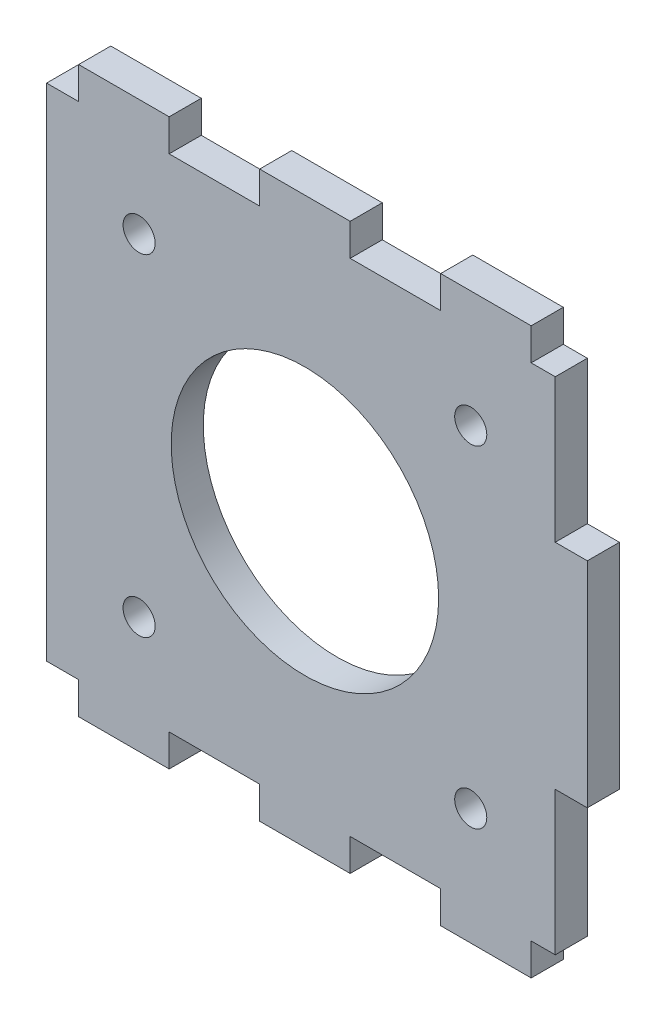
ISO-10303-21;
HEADER;
FILE_DESCRIPTION(('STEP AP214'),'2;1');
FILE_NAME('part.step','',(''),(''),'','','');
FILE_SCHEMA(('AUTOMOTIVE_DESIGN { 1 0 10303 214 1 1 1 1 }'));
ENDSEC;
DATA;
#1=APPLICATION_CONTEXT('core data for automotive mechanical design processes');
#2=APPLICATION_PROTOCOL_DEFINITION('international standard','automotive_design',2000,#1);
#3=PRODUCT_CONTEXT('',#1,'mechanical');
#4=PRODUCT('Part','Part','',(#3));
#5=PRODUCT_RELATED_PRODUCT_CATEGORY('part','',(#4));
#6=PRODUCT_DEFINITION_FORMATION('','',#4);
#7=PRODUCT_DEFINITION_CONTEXT('part definition',#1,'design');
#8=PRODUCT_DEFINITION('design','',#6,#7);
#9=PRODUCT_DEFINITION_SHAPE('','',#8);
#10=(LENGTH_UNIT() NAMED_UNIT(*) SI_UNIT(.MILLI.,.METRE.));
#11=(NAMED_UNIT(*) PLANE_ANGLE_UNIT() SI_UNIT($,.RADIAN.));
#12=(NAMED_UNIT(*) SI_UNIT($,.STERADIAN.) SOLID_ANGLE_UNIT());
#13=UNCERTAINTY_MEASURE_WITH_UNIT(LENGTH_MEASURE(1.E-05),#10,'distance_accuracy_value','');
#14=(GEOMETRIC_REPRESENTATION_CONTEXT(3) GLOBAL_UNCERTAINTY_ASSIGNED_CONTEXT((#13)) GLOBAL_UNIT_ASSIGNED_CONTEXT((#10,
#11,#12)) REPRESENTATION_CONTEXT('',''));
#15=CARTESIAN_POINT('',(0.,0.,0.));
#16=DIRECTION('',(0.,0.,1.));
#17=DIRECTION('',(1.,0.,0.));
#18=AXIS2_PLACEMENT_3D('',#15,#16,#17);
#19=CARTESIAN_POINT('',(0.,23.4000000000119,3.));
#20=DIRECTION('',(0.,-1.,0.));
#21=DIRECTION('',(0.,0.,-1.));
#22=AXIS2_PLACEMENT_3D('',#19,#20,#21);
#23=PLANE('',#22);
#24=DIRECTION('',(-1.,0.,0.));
#25=VECTOR('',#24,1.);
#26=CARTESIAN_POINT('',(0.,23.4000000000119,0.));
#27=LINE('',#26,#25);
#28=CARTESIAN_POINT('',(22.2749999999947,23.4000000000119,0.));
#29=VERTEX_POINT('',#28);
#30=CARTESIAN_POINT('',(20.0250000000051,23.4000000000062,0.));
#31=VERTEX_POINT('',#30);
#32=EDGE_CURVE('E290',#29,#31,#27,.T.);
#33=ORIENTED_EDGE('',*,*,#32,.T.);
#34=DIRECTION('',(0.,0.,-1.));
#35=VECTOR('',#34,1.);
#36=CARTESIAN_POINT('',(20.0250000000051,23.4000000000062,3.));
#37=LINE('',#36,#35);
#38=CARTESIAN_POINT('',(20.0250000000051,23.4000000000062,3.));
#39=VERTEX_POINT('',#38);
#40=EDGE_CURVE('E11',#39,#31,#37,.T.);
#41=ORIENTED_EDGE('',*,*,#40,.F.);
#42=DIRECTION('',(-1.,0.,0.));
#43=VECTOR('',#42,1.);
#44=CARTESIAN_POINT('',(0.,23.4000000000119,3.));
#45=LINE('',#44,#43);
#46=CARTESIAN_POINT('',(22.2749999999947,23.4000000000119,3.));
#47=VERTEX_POINT('',#46);
#48=EDGE_CURVE('E160',#47,#39,#45,.T.);
#49=ORIENTED_EDGE('',*,*,#48,.F.);
#50=DIRECTION('',(0.,0.,-1.));
#51=VECTOR('',#50,1.);
#52=CARTESIAN_POINT('',(22.2749999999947,23.4000000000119,3.));
#53=LINE('',#52,#51);
#54=EDGE_CURVE('E51',#47,#29,#53,.T.);
#55=ORIENTED_EDGE('',*,*,#54,.T.);
#56=EDGE_LOOP('',(#33,#41,#49,#55));
#57=FACE_BOUND('',#56,.T.);
#58=ADVANCED_FACE('F34',(#57),#23,.F.);
#59=CARTESIAN_POINT('',(20.0250000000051,0.,3.));
#60=DIRECTION('',(1.,0.,0.));
#61=DIRECTION('',(0.,0.,-1.));
#62=AXIS2_PLACEMENT_3D('',#59,#60,#61);
#63=PLANE('',#62);
#64=DIRECTION('',(0.,-1.,0.));
#65=VECTOR('',#64,1.);
#66=CARTESIAN_POINT('',(20.0250000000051,0.,0.));
#67=LINE('',#66,#65);
#68=CARTESIAN_POINT('',(20.0250000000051,26.4000000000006,0.));
#69=VERTEX_POINT('',#68);
#70=EDGE_CURVE('E292',#69,#31,#67,.T.);
#71=ORIENTED_EDGE('',*,*,#70,.F.);
#72=DIRECTION('',(0.,0.,-1.));
#73=VECTOR('',#72,1.);
#74=CARTESIAN_POINT('',(20.0250000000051,26.4000000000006,3.));
#75=LINE('',#74,#73);
#76=CARTESIAN_POINT('',(20.0250000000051,26.4000000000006,3.));
#77=VERTEX_POINT('',#76);
#78=EDGE_CURVE('E43',#77,#69,#75,.T.);
#79=ORIENTED_EDGE('',*,*,#78,.F.);
#80=DIRECTION('',(0.,-1.,0.));
#81=VECTOR('',#80,1.);
#82=CARTESIAN_POINT('',(20.0250000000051,0.,3.));
#83=LINE('',#82,#81);
#84=EDGE_CURVE('E444',#77,#39,#83,.T.);
#85=ORIENTED_EDGE('',*,*,#84,.T.);
#86=ORIENTED_EDGE('',*,*,#40,.T.);
#87=EDGE_LOOP('',(#71,#79,#85,#86));
#88=FACE_BOUND('',#87,.T.);
#89=ADVANCED_FACE('F432',(#88),#63,.T.);
#90=CARTESIAN_POINT('',(0.,26.4000000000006,3.));
#91=DIRECTION('',(0.,1.,0.));
#92=DIRECTION('',(0.,0.,1.));
#93=AXIS2_PLACEMENT_3D('',#90,#91,#92);
#94=PLANE('',#93);
#95=DIRECTION('',(1.,0.,0.));
#96=VECTOR('',#95,1.);
#97=CARTESIAN_POINT('',(0.,26.4000000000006,0.));
#98=LINE('',#97,#96);
#99=CARTESIAN_POINT('',(11.565000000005,26.4000000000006,0.));
#100=VERTEX_POINT('',#99);
#101=EDGE_CURVE('E297',#100,#69,#98,.T.);
#102=ORIENTED_EDGE('',*,*,#101,.F.);
#103=DIRECTION('',(0.,0.,-1.));
#104=VECTOR('',#103,1.);
#105=CARTESIAN_POINT('',(11.565000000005,26.4000000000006,3.));
#106=LINE('',#105,#104);
#107=CARTESIAN_POINT('',(11.565000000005,26.4000000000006,3.));
#108=VERTEX_POINT('',#107);
#109=EDGE_CURVE('E422',#108,#100,#106,.T.);
#110=ORIENTED_EDGE('',*,*,#109,.F.);
#111=DIRECTION('',(1.,0.,0.));
#112=VECTOR('',#111,1.);
#113=CARTESIAN_POINT('',(0.,26.4000000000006,3.));
#114=LINE('',#113,#112);
#115=EDGE_CURVE('E429',#108,#77,#114,.T.);
#116=ORIENTED_EDGE('',*,*,#115,.T.);
#117=ORIENTED_EDGE('',*,*,#78,.T.);
#118=EDGE_LOOP('',(#102,#110,#116,#117));
#119=FACE_BOUND('',#118,.T.);
#120=ADVANCED_FACE('F427',(#119),#94,.T.);
#121=CARTESIAN_POINT('',(11.565000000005,0.,3.));
#122=DIRECTION('',(-1.,0.,0.));
#123=DIRECTION('',(0.,0.,1.));
#124=AXIS2_PLACEMENT_3D('',#121,#122,#123);
#125=PLANE('',#124);
#126=DIRECTION('',(0.,1.,0.));
#127=VECTOR('',#126,1.);
#128=CARTESIAN_POINT('',(11.565000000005,0.,0.));
#129=LINE('',#128,#127);
#130=CARTESIAN_POINT('',(11.565000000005,23.4000000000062,0.));
#131=VERTEX_POINT('',#130);
#132=EDGE_CURVE('E300',#131,#100,#129,.T.);
#133=ORIENTED_EDGE('',*,*,#132,.F.);
#134=DIRECTION('',(0.,0.,-1.));
#135=VECTOR('',#134,1.);
#136=CARTESIAN_POINT('',(11.565000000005,23.4000000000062,3.));
#137=LINE('',#136,#135);
#138=CARTESIAN_POINT('',(11.565000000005,23.4000000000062,3.));
#139=VERTEX_POINT('',#138);
#140=EDGE_CURVE('E420',#139,#131,#137,.T.);
#141=ORIENTED_EDGE('',*,*,#140,.F.);
#142=DIRECTION('',(0.,1.,0.));
#143=VECTOR('',#142,1.);
#144=CARTESIAN_POINT('',(11.565000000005,0.,3.));
#145=LINE('',#144,#143);
#146=EDGE_CURVE('E443',#139,#108,#145,.T.);
#147=ORIENTED_EDGE('',*,*,#146,.T.);
#148=ORIENTED_EDGE('',*,*,#109,.T.);
#149=EDGE_LOOP('',(#133,#141,#147,#148));
#150=FACE_BOUND('',#149,.T.);
#151=ADVANCED_FACE('F439',(#150),#125,.T.);
#152=CARTESIAN_POINT('',(3.10500000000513,23.4000000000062,0.));
#153=VERTEX_POINT('',#152);
#154=EDGE_CURVE('E294',#131,#153,#27,.T.);
#155=ORIENTED_EDGE('',*,*,#154,.T.);
#156=DIRECTION('',(0.,0.,-1.));
#157=VECTOR('',#156,1.);
#158=CARTESIAN_POINT('',(3.10500000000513,23.4000000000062,3.));
#159=LINE('',#158,#157);
#160=CARTESIAN_POINT('',(3.10500000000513,23.4000000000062,3.));
#161=VERTEX_POINT('',#160);
#162=EDGE_CURVE('E418',#161,#153,#159,.T.);
#163=ORIENTED_EDGE('',*,*,#162,.F.);
#164=EDGE_CURVE('E446',#139,#161,#45,.T.);
#165=ORIENTED_EDGE('',*,*,#164,.F.);
#166=ORIENTED_EDGE('',*,*,#140,.T.);
#167=EDGE_LOOP('',(#155,#163,#165,#166));
#168=FACE_BOUND('',#167,.T.);
#169=ADVANCED_FACE('F630',(#168),#23,.F.);
#170=CARTESIAN_POINT('',(3.10500000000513,0.,3.));
#171=DIRECTION('',(1.,0.,0.));
#172=DIRECTION('',(0.,0.,-1.));
#173=AXIS2_PLACEMENT_3D('',#170,#171,#172);
#174=PLANE('',#173);
#175=DIRECTION('',(0.,-1.,0.));
#176=VECTOR('',#175,1.);
#177=CARTESIAN_POINT('',(3.10500000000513,0.,0.));
#178=LINE('',#177,#176);
#179=CARTESIAN_POINT('',(3.10500000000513,26.4000000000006,0.));
#180=VERTEX_POINT('',#179);
#181=EDGE_CURVE('E303',#180,#153,#178,.T.);
#182=ORIENTED_EDGE('',*,*,#181,.F.);
#183=DIRECTION('',(0.,0.,-1.));
#184=VECTOR('',#183,1.);
#185=CARTESIAN_POINT('',(3.10500000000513,26.4000000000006,3.));
#186=LINE('',#185,#184);
#187=CARTESIAN_POINT('',(3.10500000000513,26.4000000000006,3.));
#188=VERTEX_POINT('',#187);
#189=EDGE_CURVE('E416',#188,#180,#186,.T.);
#190=ORIENTED_EDGE('',*,*,#189,.F.);
#191=DIRECTION('',(0.,-1.,0.));
#192=VECTOR('',#191,1.);
#193=CARTESIAN_POINT('',(3.10500000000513,0.,3.));
#194=LINE('',#193,#192);
#195=EDGE_CURVE('E451',#188,#161,#194,.T.);
#196=ORIENTED_EDGE('',*,*,#195,.T.);
#197=ORIENTED_EDGE('',*,*,#162,.T.);
#198=EDGE_LOOP('',(#182,#190,#196,#197));
#199=FACE_BOUND('',#198,.T.);
#200=ADVANCED_FACE('F638',(#199),#174,.T.);
#201=CARTESIAN_POINT('',(0.,26.4000000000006,3.));
#202=DIRECTION('',(0.,1.,0.));
#203=DIRECTION('',(0.,0.,1.));
#204=AXIS2_PLACEMENT_3D('',#201,#202,#203);
#205=PLANE('',#204);
#206=DIRECTION('',(1.,0.,0.));
#207=VECTOR('',#206,1.);
#208=CARTESIAN_POINT('',(0.,26.4000000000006,0.));
#209=LINE('',#208,#207);
#210=CARTESIAN_POINT('',(-5.35499999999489,26.4000000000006,0.));
#211=VERTEX_POINT('',#210);
#212=EDGE_CURVE('E306',#211,#180,#209,.T.);
#213=ORIENTED_EDGE('',*,*,#212,.F.);
#214=DIRECTION('',(0.,0.,-1.));
#215=VECTOR('',#214,1.);
#216=CARTESIAN_POINT('',(-5.35499999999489,26.4000000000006,3.));
#217=LINE('',#216,#215);
#218=CARTESIAN_POINT('',(-5.35499999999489,26.4000000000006,3.));
#219=VERTEX_POINT('',#218);
#220=EDGE_CURVE('E414',#219,#211,#217,.T.);
#221=ORIENTED_EDGE('',*,*,#220,.F.);
#222=DIRECTION('',(1.,0.,0.));
#223=VECTOR('',#222,1.);
#224=CARTESIAN_POINT('',(0.,26.4000000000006,3.));
#225=LINE('',#224,#223);
#226=EDGE_CURVE('E454',#219,#188,#225,.T.);
#227=ORIENTED_EDGE('',*,*,#226,.T.);
#228=ORIENTED_EDGE('',*,*,#189,.T.);
#229=EDGE_LOOP('',(#213,#221,#227,#228));
#230=FACE_BOUND('',#229,.T.);
#231=ADVANCED_FACE('F652',(#230),#205,.T.);
#232=CARTESIAN_POINT('',(-5.35499999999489,0.,3.));
#233=DIRECTION('',(-1.,0.,0.));
#234=DIRECTION('',(0.,0.,1.));
#235=AXIS2_PLACEMENT_3D('',#232,#233,#234);
#236=PLANE('',#235);
#237=DIRECTION('',(0.,1.,0.));
#238=VECTOR('',#237,1.);
#239=CARTESIAN_POINT('',(-5.35499999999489,0.,0.));
#240=LINE('',#239,#238);
#241=CARTESIAN_POINT('',(-5.35499999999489,23.4000000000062,0.));
#242=VERTEX_POINT('',#241);
#243=EDGE_CURVE('E309',#242,#211,#240,.T.);
#244=ORIENTED_EDGE('',*,*,#243,.F.);
#245=DIRECTION('',(0.,0.,-1.));
#246=VECTOR('',#245,1.);
#247=CARTESIAN_POINT('',(-5.35499999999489,23.4000000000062,3.));
#248=LINE('',#247,#246);
#249=CARTESIAN_POINT('',(-5.35499999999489,23.4000000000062,3.));
#250=VERTEX_POINT('',#249);
#251=EDGE_CURVE('E412',#250,#242,#248,.T.);
#252=ORIENTED_EDGE('',*,*,#251,.F.);
#253=DIRECTION('',(0.,1.,0.));
#254=VECTOR('',#253,1.);
#255=CARTESIAN_POINT('',(-5.35499999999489,0.,3.));
#256=LINE('',#255,#254);
#257=EDGE_CURVE('E457',#250,#219,#256,.T.);
#258=ORIENTED_EDGE('',*,*,#257,.T.);
#259=ORIENTED_EDGE('',*,*,#220,.T.);
#260=EDGE_LOOP('',(#244,#252,#258,#259));
#261=FACE_BOUND('',#260,.T.);
#262=ADVANCED_FACE('F646',(#261),#236,.T.);
#263=CARTESIAN_POINT('',(-13.8149999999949,23.4000000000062,0.));
#264=VERTEX_POINT('',#263);
#265=EDGE_CURVE('E312',#242,#264,#27,.T.);
#266=ORIENTED_EDGE('',*,*,#265,.T.);
#267=DIRECTION('',(0.,0.,-1.));
#268=VECTOR('',#267,1.);
#269=CARTESIAN_POINT('',(-13.8149999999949,23.4000000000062,3.));
#270=LINE('',#269,#268);
#271=CARTESIAN_POINT('',(-13.8149999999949,23.4000000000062,3.));
#272=VERTEX_POINT('',#271);
#273=EDGE_CURVE('E410',#272,#264,#270,.T.);
#274=ORIENTED_EDGE('',*,*,#273,.F.);
#275=EDGE_CURVE('E460',#250,#272,#45,.T.);
#276=ORIENTED_EDGE('',*,*,#275,.F.);
#277=ORIENTED_EDGE('',*,*,#251,.T.);
#278=EDGE_LOOP('',(#266,#274,#276,#277));
#279=FACE_BOUND('',#278,.T.);
#280=ADVANCED_FACE('F538',(#279),#23,.F.);
#281=CARTESIAN_POINT('',(-13.8149999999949,0.,3.));
#282=DIRECTION('',(1.,0.,0.));
#283=DIRECTION('',(0.,0.,-1.));
#284=AXIS2_PLACEMENT_3D('',#281,#282,#283);
#285=PLANE('',#284);
#286=DIRECTION('',(0.,-1.,0.));
#287=VECTOR('',#286,1.);
#288=CARTESIAN_POINT('',(-13.8149999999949,0.,0.));
#289=LINE('',#288,#287);
#290=CARTESIAN_POINT('',(-13.8149999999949,26.4000000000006,0.));
#291=VERTEX_POINT('',#290);
#292=EDGE_CURVE('E313',#291,#264,#289,.T.);
#293=ORIENTED_EDGE('',*,*,#292,.F.);
#294=DIRECTION('',(0.,0.,-1.));
#295=VECTOR('',#294,1.);
#296=CARTESIAN_POINT('',(-13.8149999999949,26.4000000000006,3.));
#297=LINE('',#296,#295);
#298=CARTESIAN_POINT('',(-13.8149999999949,26.4000000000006,3.));
#299=VERTEX_POINT('',#298);
#300=EDGE_CURVE('E408',#299,#291,#297,.T.);
#301=ORIENTED_EDGE('',*,*,#300,.F.);
#302=DIRECTION('',(0.,-1.,0.));
#303=VECTOR('',#302,1.);
#304=CARTESIAN_POINT('',(-13.8149999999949,0.,3.));
#305=LINE('',#304,#303);
#306=EDGE_CURVE('E461',#299,#272,#305,.T.);
#307=ORIENTED_EDGE('',*,*,#306,.T.);
#308=ORIENTED_EDGE('',*,*,#273,.T.);
#309=EDGE_LOOP('',(#293,#301,#307,#308));
#310=FACE_BOUND('',#309,.T.);
#311=ADVANCED_FACE('F542',(#310),#285,.T.);
#312=CARTESIAN_POINT('',(0.,26.4000000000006,3.));
#313=DIRECTION('',(0.,1.,0.));
#314=DIRECTION('',(0.,0.,1.));
#315=AXIS2_PLACEMENT_3D('',#312,#313,#314);
#316=PLANE('',#315);
#317=DIRECTION('',(1.,0.,0.));
#318=VECTOR('',#317,1.);
#319=CARTESIAN_POINT('',(0.,26.4000000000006,0.));
#320=LINE('',#319,#318);
#321=CARTESIAN_POINT('',(-22.2749999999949,26.4000000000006,0.));
#322=VERTEX_POINT('',#321);
#323=EDGE_CURVE('E316',#322,#291,#320,.T.);
#324=ORIENTED_EDGE('',*,*,#323,.F.);
#325=DIRECTION('',(0.,0.,-1.));
#326=VECTOR('',#325,1.);
#327=CARTESIAN_POINT('',(-22.2749999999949,26.4000000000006,3.));
#328=LINE('',#327,#326);
#329=CARTESIAN_POINT('',(-22.2749999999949,26.4000000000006,3.));
#330=VERTEX_POINT('',#329);
#331=EDGE_CURVE('E406',#330,#322,#328,.T.);
#332=ORIENTED_EDGE('',*,*,#331,.F.);
#333=DIRECTION('',(1.,0.,0.));
#334=VECTOR('',#333,1.);
#335=CARTESIAN_POINT('',(0.,26.4000000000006,3.));
#336=LINE('',#335,#334);
#337=EDGE_CURVE('E464',#330,#299,#336,.T.);
#338=ORIENTED_EDGE('',*,*,#337,.T.);
#339=ORIENTED_EDGE('',*,*,#300,.T.);
#340=EDGE_LOOP('',(#324,#332,#338,#339));
#341=FACE_BOUND('',#340,.T.);
#342=ADVANCED_FACE('F545',(#341),#316,.T.);
#343=CARTESIAN_POINT('',(-22.2749999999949,0.,3.));
#344=DIRECTION('',(-1.,0.,0.));
#345=DIRECTION('',(0.,0.,1.));
#346=AXIS2_PLACEMENT_3D('',#343,#344,#345);
#347=PLANE('',#346);
#348=DIRECTION('',(0.,1.,0.));
#349=VECTOR('',#348,1.);
#350=CARTESIAN_POINT('',(-22.2749999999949,0.,0.));
#351=LINE('',#350,#349);
#352=CARTESIAN_POINT('',(-22.2749999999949,23.4000000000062,0.));
#353=VERTEX_POINT('',#352);
#354=EDGE_CURVE('E319',#353,#322,#351,.T.);
#355=ORIENTED_EDGE('',*,*,#354,.F.);
#356=DIRECTION('',(0.,0.,-1.));
#357=VECTOR('',#356,1.);
#358=CARTESIAN_POINT('',(-22.2749999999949,23.4000000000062,3.));
#359=LINE('',#358,#357);
#360=CARTESIAN_POINT('',(-22.2749999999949,23.4000000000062,3.));
#361=VERTEX_POINT('',#360);
#362=EDGE_CURVE('E404',#361,#353,#359,.T.);
#363=ORIENTED_EDGE('',*,*,#362,.F.);
#364=DIRECTION('',(0.,1.,0.));
#365=VECTOR('',#364,1.);
#366=CARTESIAN_POINT('',(-22.2749999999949,0.,3.));
#367=LINE('',#366,#365);
#368=EDGE_CURVE('E467',#361,#330,#367,.T.);
#369=ORIENTED_EDGE('',*,*,#368,.T.);
#370=ORIENTED_EDGE('',*,*,#331,.T.);
#371=EDGE_LOOP('',(#355,#363,#369,#370));
#372=FACE_BOUND('',#371,.T.);
#373=ADVANCED_FACE('F549',(#372),#347,.T.);
#374=CARTESIAN_POINT('',(-25.2749999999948,23.4000000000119,0.));
#375=VERTEX_POINT('',#374);
#376=EDGE_CURVE('E293',#353,#375,#27,.T.);
#377=ORIENTED_EDGE('',*,*,#376,.T.);
#378=DIRECTION('',(0.,0.,-1.));
#379=VECTOR('',#378,1.);
#380=CARTESIAN_POINT('',(-25.2749999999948,23.4000000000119,3.));
#381=LINE('',#380,#379);
#382=CARTESIAN_POINT('',(-25.2749999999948,23.4000000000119,3.));
#383=VERTEX_POINT('',#382);
#384=EDGE_CURVE('E401',#383,#375,#381,.T.);
#385=ORIENTED_EDGE('',*,*,#384,.F.);
#386=EDGE_CURVE('E470',#361,#383,#45,.T.);
#387=ORIENTED_EDGE('',*,*,#386,.F.);
#388=ORIENTED_EDGE('',*,*,#362,.T.);
#389=EDGE_LOOP('',(#377,#385,#387,#388));
#390=FACE_BOUND('',#389,.T.);
#391=ADVANCED_FACE('F554',(#390),#23,.F.);
#392=CARTESIAN_POINT('',(-25.2749999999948,0.,3.));
#393=DIRECTION('',(1.,0.,0.));
#394=DIRECTION('',(0.,0.,-1.));
#395=AXIS2_PLACEMENT_3D('',#392,#393,#394);
#396=PLANE('',#395);
#397=DIRECTION('',(0.,-1.,0.));
#398=VECTOR('',#397,1.);
#399=CARTESIAN_POINT('',(-25.2749999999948,0.,0.));
#400=LINE('',#399,#398);
#401=CARTESIAN_POINT('',(-25.2749999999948,-23.4000000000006,0.));
#402=VERTEX_POINT('',#401);
#403=EDGE_CURVE('E322',#375,#402,#400,.T.);
#404=ORIENTED_EDGE('',*,*,#403,.T.);
#405=DIRECTION('',(0.,0.,-1.));
#406=VECTOR('',#405,1.);
#407=CARTESIAN_POINT('',(-25.2749999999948,-23.4000000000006,3.));
#408=LINE('',#407,#406);
#409=CARTESIAN_POINT('',(-25.2749999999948,-23.4000000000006,3.));
#410=VERTEX_POINT('',#409);
#411=EDGE_CURVE('E399',#410,#402,#408,.T.);
#412=ORIENTED_EDGE('',*,*,#411,.F.);
#413=DIRECTION('',(0.,-1.,0.));
#414=VECTOR('',#413,1.);
#415=CARTESIAN_POINT('',(-25.2749999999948,0.,3.));
#416=LINE('',#415,#414);
#417=EDGE_CURVE('E471',#383,#410,#416,.T.);
#418=ORIENTED_EDGE('',*,*,#417,.F.);
#419=ORIENTED_EDGE('',*,*,#384,.T.);
#420=EDGE_LOOP('',(#404,#412,#418,#419));
#421=FACE_BOUND('',#420,.T.);
#422=ADVANCED_FACE('F560',(#421),#396,.F.);
#423=CARTESIAN_POINT('',(0.,-23.4000000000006,3.));
#424=DIRECTION('',(0.,-1.,0.));
#425=DIRECTION('',(0.,0.,-1.));
#426=AXIS2_PLACEMENT_3D('',#423,#424,#425);
#427=PLANE('',#426);
#428=DIRECTION('',(-1.,0.,0.));
#429=VECTOR('',#428,1.);
#430=CARTESIAN_POINT('',(0.,-23.4000000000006,0.));
#431=LINE('',#430,#429);
#432=CARTESIAN_POINT('',(-22.2749999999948,-23.4000000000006,0.));
#433=VERTEX_POINT('',#432);
#434=EDGE_CURVE('E325',#433,#402,#431,.T.);
#435=ORIENTED_EDGE('',*,*,#434,.F.);
#436=DIRECTION('',(0.,0.,-1.));
#437=VECTOR('',#436,1.);
#438=CARTESIAN_POINT('',(-22.2749999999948,-23.4000000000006,3.));
#439=LINE('',#438,#437);
#440=CARTESIAN_POINT('',(-22.2749999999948,-23.4000000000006,3.));
#441=VERTEX_POINT('',#440);
#442=EDGE_CURVE('E397',#441,#433,#439,.T.);
#443=ORIENTED_EDGE('',*,*,#442,.F.);
#444=DIRECTION('',(-1.,0.,0.));
#445=VECTOR('',#444,1.);
#446=CARTESIAN_POINT('',(0.,-23.4000000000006,3.));
#447=LINE('',#446,#445);
#448=EDGE_CURVE('E473',#441,#410,#447,.T.);
#449=ORIENTED_EDGE('',*,*,#448,.T.);
#450=ORIENTED_EDGE('',*,*,#411,.T.);
#451=EDGE_LOOP('',(#435,#443,#449,#450));
#452=FACE_BOUND('',#451,.T.);
#453=ADVANCED_FACE('F564',(#452),#427,.T.);
#454=CARTESIAN_POINT('',(-22.2749999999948,0.,3.));
#455=DIRECTION('',(-1.,0.,0.));
#456=DIRECTION('',(0.,0.,1.));
#457=AXIS2_PLACEMENT_3D('',#454,#455,#456);
#458=PLANE('',#457);
#459=DIRECTION('',(0.,1.,0.));
#460=VECTOR('',#459,1.);
#461=CARTESIAN_POINT('',(-22.2749999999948,0.,0.));
#462=LINE('',#461,#460);
#463=CARTESIAN_POINT('',(-22.2749999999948,-26.4000000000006,0.));
#464=VERTEX_POINT('',#463);
#465=EDGE_CURVE('E328',#464,#433,#462,.T.);
#466=ORIENTED_EDGE('',*,*,#465,.F.);
#467=DIRECTION('',(0.,0.,-1.));
#468=VECTOR('',#467,1.);
#469=CARTESIAN_POINT('',(-22.2749999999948,-26.4000000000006,3.));
#470=LINE('',#469,#468);
#471=CARTESIAN_POINT('',(-22.2749999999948,-26.4000000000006,3.));
#472=VERTEX_POINT('',#471);
#473=EDGE_CURVE('E395',#472,#464,#470,.T.);
#474=ORIENTED_EDGE('',*,*,#473,.F.);
#475=DIRECTION('',(0.,1.,0.));
#476=VECTOR('',#475,1.);
#477=CARTESIAN_POINT('',(-22.2749999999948,0.,3.));
#478=LINE('',#477,#476);
#479=EDGE_CURVE('E476',#472,#441,#478,.T.);
#480=ORIENTED_EDGE('',*,*,#479,.T.);
#481=ORIENTED_EDGE('',*,*,#442,.T.);
#482=EDGE_LOOP('',(#466,#474,#480,#481));
#483=FACE_BOUND('',#482,.T.);
#484=ADVANCED_FACE('F567',(#483),#458,.T.);
#485=CARTESIAN_POINT('',(0.,-26.4000000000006,3.));
#486=DIRECTION('',(0.,-1.,0.));
#487=DIRECTION('',(0.,0.,-1.));
#488=AXIS2_PLACEMENT_3D('',#485,#486,#487);
#489=PLANE('',#488);
#490=DIRECTION('',(-1.,0.,0.));
#491=VECTOR('',#490,1.);
#492=CARTESIAN_POINT('',(0.,-26.4000000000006,0.));
#493=LINE('',#492,#491);
#494=CARTESIAN_POINT('',(-13.8149999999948,-26.4000000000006,0.));
#495=VERTEX_POINT('',#494);
#496=EDGE_CURVE('E333',#495,#464,#493,.T.);
#497=ORIENTED_EDGE('',*,*,#496,.F.);
#498=DIRECTION('',(0.,0.,-1.));
#499=VECTOR('',#498,1.);
#500=CARTESIAN_POINT('',(-13.8149999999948,-26.4000000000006,3.));
#501=LINE('',#500,#499);
#502=CARTESIAN_POINT('',(-13.8149999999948,-26.4000000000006,3.));
#503=VERTEX_POINT('',#502);
#504=EDGE_CURVE('E393',#503,#495,#501,.T.);
#505=ORIENTED_EDGE('',*,*,#504,.F.);
#506=DIRECTION('',(-1.,0.,0.));
#507=VECTOR('',#506,1.);
#508=CARTESIAN_POINT('',(0.,-26.4000000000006,3.));
#509=LINE('',#508,#507);
#510=EDGE_CURVE('E481',#503,#472,#509,.T.);
#511=ORIENTED_EDGE('',*,*,#510,.T.);
#512=ORIENTED_EDGE('',*,*,#473,.T.);
#513=EDGE_LOOP('',(#497,#505,#511,#512));
#514=FACE_BOUND('',#513,.T.);
#515=ADVANCED_FACE('F572',(#514),#489,.T.);
#516=CARTESIAN_POINT('',(-13.8149999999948,0.,3.));
#517=DIRECTION('',(1.,0.,0.));
#518=DIRECTION('',(0.,0.,-1.));
#519=AXIS2_PLACEMENT_3D('',#516,#517,#518);
#520=PLANE('',#519);
#521=DIRECTION('',(0.,-1.,0.));
#522=VECTOR('',#521,1.);
#523=CARTESIAN_POINT('',(-13.8149999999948,0.,0.));
#524=LINE('',#523,#522);
#525=CARTESIAN_POINT('',(-13.8149999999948,-23.4000000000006,0.));
#526=VERTEX_POINT('',#525);
#527=EDGE_CURVE('E336',#526,#495,#524,.T.);
#528=ORIENTED_EDGE('',*,*,#527,.F.);
#529=DIRECTION('',(0.,0.,-1.));
#530=VECTOR('',#529,1.);
#531=CARTESIAN_POINT('',(-13.8149999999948,-23.4000000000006,3.));
#532=LINE('',#531,#530);
#533=CARTESIAN_POINT('',(-13.8149999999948,-23.4000000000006,3.));
#534=VERTEX_POINT('',#533);
#535=EDGE_CURVE('E391',#534,#526,#532,.T.);
#536=ORIENTED_EDGE('',*,*,#535,.F.);
#537=DIRECTION('',(0.,-1.,0.));
#538=VECTOR('',#537,1.);
#539=CARTESIAN_POINT('',(-13.8149999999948,0.,3.));
#540=LINE('',#539,#538);
#541=EDGE_CURVE('E484',#534,#503,#540,.T.);
#542=ORIENTED_EDGE('',*,*,#541,.T.);
#543=ORIENTED_EDGE('',*,*,#504,.T.);
#544=EDGE_LOOP('',(#528,#536,#542,#543));
#545=FACE_BOUND('',#544,.T.);
#546=ADVANCED_FACE('F575',(#545),#520,.T.);
#547=CARTESIAN_POINT('',(-5.35499999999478,-23.4000000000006,0.));
#548=VERTEX_POINT('',#547);
#549=EDGE_CURVE('E330',#548,#526,#431,.T.);
#550=ORIENTED_EDGE('',*,*,#549,.F.);
#551=DIRECTION('',(0.,0.,-1.));
#552=VECTOR('',#551,1.);
#553=CARTESIAN_POINT('',(-5.35499999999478,-23.4000000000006,3.));
#554=LINE('',#553,#552);
#555=CARTESIAN_POINT('',(-5.35499999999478,-23.4000000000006,3.));
#556=VERTEX_POINT('',#555);
#557=EDGE_CURVE('E389',#556,#548,#554,.T.);
#558=ORIENTED_EDGE('',*,*,#557,.F.);
#559=EDGE_CURVE('E478',#556,#534,#447,.T.);
#560=ORIENTED_EDGE('',*,*,#559,.T.);
#561=ORIENTED_EDGE('',*,*,#535,.T.);
#562=EDGE_LOOP('',(#550,#558,#560,#561));
#563=FACE_BOUND('',#562,.T.);
#564=ADVANCED_FACE('F582',(#563),#427,.T.);
#565=CARTESIAN_POINT('',(-5.35499999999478,0.,3.));
#566=DIRECTION('',(-1.,0.,0.));
#567=DIRECTION('',(0.,0.,1.));
#568=AXIS2_PLACEMENT_3D('',#565,#566,#567);
#569=PLANE('',#568);
#570=DIRECTION('',(0.,1.,0.));
#571=VECTOR('',#570,1.);
#572=CARTESIAN_POINT('',(-5.35499999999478,0.,0.));
#573=LINE('',#572,#571);
#574=CARTESIAN_POINT('',(-5.35499999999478,-26.4000000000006,0.));
#575=VERTEX_POINT('',#574);
#576=EDGE_CURVE('E339',#575,#548,#573,.T.);
#577=ORIENTED_EDGE('',*,*,#576,.F.);
#578=DIRECTION('',(0.,0.,-1.));
#579=VECTOR('',#578,1.);
#580=CARTESIAN_POINT('',(-5.35499999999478,-26.4000000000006,3.));
#581=LINE('',#580,#579);
#582=CARTESIAN_POINT('',(-5.35499999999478,-26.4000000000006,3.));
#583=VERTEX_POINT('',#582);
#584=EDGE_CURVE('E387',#583,#575,#581,.T.);
#585=ORIENTED_EDGE('',*,*,#584,.F.);
#586=DIRECTION('',(0.,1.,0.));
#587=VECTOR('',#586,1.);
#588=CARTESIAN_POINT('',(-5.35499999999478,0.,3.));
#589=LINE('',#588,#587);
#590=EDGE_CURVE('E487',#583,#556,#589,.T.);
#591=ORIENTED_EDGE('',*,*,#590,.T.);
#592=ORIENTED_EDGE('',*,*,#557,.T.);
#593=EDGE_LOOP('',(#577,#585,#591,#592));
#594=FACE_BOUND('',#593,.T.);
#595=ADVANCED_FACE('F602',(#594),#569,.T.);
#596=CARTESIAN_POINT('',(0.,-26.4000000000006,3.));
#597=DIRECTION('',(0.,-1.,0.));
#598=DIRECTION('',(0.,0.,-1.));
#599=AXIS2_PLACEMENT_3D('',#596,#597,#598);
#600=PLANE('',#599);
#601=DIRECTION('',(-1.,0.,0.));
#602=VECTOR('',#601,1.);
#603=CARTESIAN_POINT('',(0.,-26.4000000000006,0.));
#604=LINE('',#603,#602);
#605=CARTESIAN_POINT('',(3.10500000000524,-26.4000000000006,0.));
#606=VERTEX_POINT('',#605);
#607=EDGE_CURVE('E342',#606,#575,#604,.T.);
#608=ORIENTED_EDGE('',*,*,#607,.F.);
#609=DIRECTION('',(0.,0.,-1.));
#610=VECTOR('',#609,1.);
#611=CARTESIAN_POINT('',(3.10500000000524,-26.4000000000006,3.));
#612=LINE('',#611,#610);
#613=CARTESIAN_POINT('',(3.10500000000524,-26.4000000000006,3.));
#614=VERTEX_POINT('',#613);
#615=EDGE_CURVE('E385',#614,#606,#612,.T.);
#616=ORIENTED_EDGE('',*,*,#615,.F.);
#617=DIRECTION('',(-1.,0.,0.));
#618=VECTOR('',#617,1.);
#619=CARTESIAN_POINT('',(0.,-26.4000000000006,3.));
#620=LINE('',#619,#618);
#621=EDGE_CURVE('E490',#614,#583,#620,.T.);
#622=ORIENTED_EDGE('',*,*,#621,.T.);
#623=ORIENTED_EDGE('',*,*,#584,.T.);
#624=EDGE_LOOP('',(#608,#616,#622,#623));
#625=FACE_BOUND('',#624,.T.);
#626=ADVANCED_FACE('F606',(#625),#600,.T.);
#627=CARTESIAN_POINT('',(3.10500000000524,0.,3.));
#628=DIRECTION('',(1.,0.,0.));
#629=DIRECTION('',(0.,0.,-1.));
#630=AXIS2_PLACEMENT_3D('',#627,#628,#629);
#631=PLANE('',#630);
#632=DIRECTION('',(0.,-1.,0.));
#633=VECTOR('',#632,1.);
#634=CARTESIAN_POINT('',(3.10500000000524,0.,0.));
#635=LINE('',#634,#633);
#636=CARTESIAN_POINT('',(3.10500000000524,-23.4000000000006,0.));
#637=VERTEX_POINT('',#636);
#638=EDGE_CURVE('E345',#637,#606,#635,.T.);
#639=ORIENTED_EDGE('',*,*,#638,.F.);
#640=DIRECTION('',(0.,0.,-1.));
#641=VECTOR('',#640,1.);
#642=CARTESIAN_POINT('',(3.10500000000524,-23.4000000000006,3.));
#643=LINE('',#642,#641);
#644=CARTESIAN_POINT('',(3.10500000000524,-23.4000000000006,3.));
#645=VERTEX_POINT('',#644);
#646=EDGE_CURVE('E383',#645,#637,#643,.T.);
#647=ORIENTED_EDGE('',*,*,#646,.F.);
#648=DIRECTION('',(0.,-1.,0.));
#649=VECTOR('',#648,1.);
#650=CARTESIAN_POINT('',(3.10500000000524,0.,3.));
#651=LINE('',#650,#649);
#652=EDGE_CURVE('E493',#645,#614,#651,.T.);
#653=ORIENTED_EDGE('',*,*,#652,.T.);
#654=ORIENTED_EDGE('',*,*,#615,.T.);
#655=EDGE_LOOP('',(#639,#647,#653,#654));
#656=FACE_BOUND('',#655,.T.);
#657=ADVANCED_FACE('F609',(#656),#631,.T.);
#658=CARTESIAN_POINT('',(11.5650000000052,-23.4000000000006,0.));
#659=VERTEX_POINT('',#658);
#660=EDGE_CURVE('E348',#659,#637,#431,.T.);
#661=ORIENTED_EDGE('',*,*,#660,.F.);
#662=DIRECTION('',(0.,0.,-1.));
#663=VECTOR('',#662,1.);
#664=CARTESIAN_POINT('',(11.5650000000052,-23.4000000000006,3.));
#665=LINE('',#664,#663);
#666=CARTESIAN_POINT('',(11.5650000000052,-23.4000000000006,3.));
#667=VERTEX_POINT('',#666);
#668=EDGE_CURVE('E381',#667,#659,#665,.T.);
#669=ORIENTED_EDGE('',*,*,#668,.F.);
#670=EDGE_CURVE('E496',#667,#645,#447,.T.);
#671=ORIENTED_EDGE('',*,*,#670,.T.);
#672=ORIENTED_EDGE('',*,*,#646,.T.);
#673=EDGE_LOOP('',(#661,#669,#671,#672));
#674=FACE_BOUND('',#673,.T.);
#675=ADVANCED_FACE('F626',(#674),#427,.T.);
#676=CARTESIAN_POINT('',(11.5650000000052,0.,3.));
#677=DIRECTION('',(-1.,0.,0.));
#678=DIRECTION('',(0.,0.,1.));
#679=AXIS2_PLACEMENT_3D('',#676,#677,#678);
#680=PLANE('',#679);
#681=DIRECTION('',(0.,1.,0.));
#682=VECTOR('',#681,1.);
#683=CARTESIAN_POINT('',(11.5650000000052,0.,0.));
#684=LINE('',#683,#682);
#685=CARTESIAN_POINT('',(11.5650000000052,-26.4000000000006,0.));
#686=VERTEX_POINT('',#685);
#687=EDGE_CURVE('E349',#686,#659,#684,.T.);
#688=ORIENTED_EDGE('',*,*,#687,.F.);
#689=DIRECTION('',(0.,0.,-1.));
#690=VECTOR('',#689,1.);
#691=CARTESIAN_POINT('',(11.5650000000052,-26.4000000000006,3.));
#692=LINE('',#691,#690);
#693=CARTESIAN_POINT('',(11.5650000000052,-26.4000000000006,3.));
#694=VERTEX_POINT('',#693);
#695=EDGE_CURVE('E379',#694,#686,#692,.T.);
#696=ORIENTED_EDGE('',*,*,#695,.F.);
#697=DIRECTION('',(0.,1.,0.));
#698=VECTOR('',#697,1.);
#699=CARTESIAN_POINT('',(11.5650000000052,0.,3.));
#700=LINE('',#699,#698);
#701=EDGE_CURVE('E497',#694,#667,#700,.T.);
#702=ORIENTED_EDGE('',*,*,#701,.T.);
#703=ORIENTED_EDGE('',*,*,#668,.T.);
#704=EDGE_LOOP('',(#688,#696,#702,#703));
#705=FACE_BOUND('',#704,.T.);
#706=ADVANCED_FACE('F613',(#705),#680,.T.);
#707=CARTESIAN_POINT('',(0.,-26.4000000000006,3.));
#708=DIRECTION('',(0.,-1.,0.));
#709=DIRECTION('',(0.,0.,-1.));
#710=AXIS2_PLACEMENT_3D('',#707,#708,#709);
#711=PLANE('',#710);
#712=DIRECTION('',(-1.,0.,0.));
#713=VECTOR('',#712,1.);
#714=CARTESIAN_POINT('',(0.,-26.4000000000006,0.));
#715=LINE('',#714,#713);
#716=CARTESIAN_POINT('',(20.0250000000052,-26.4000000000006,0.));
#717=VERTEX_POINT('',#716);
#718=EDGE_CURVE('E352',#717,#686,#715,.T.);
#719=ORIENTED_EDGE('',*,*,#718,.F.);
#720=DIRECTION('',(0.,0.,-1.));
#721=VECTOR('',#720,1.);
#722=CARTESIAN_POINT('',(20.0250000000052,-26.4000000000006,3.));
#723=LINE('',#722,#721);
#724=CARTESIAN_POINT('',(20.0250000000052,-26.4000000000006,3.));
#725=VERTEX_POINT('',#724);
#726=EDGE_CURVE('E377',#725,#717,#723,.T.);
#727=ORIENTED_EDGE('',*,*,#726,.F.);
#728=DIRECTION('',(-1.,0.,0.));
#729=VECTOR('',#728,1.);
#730=CARTESIAN_POINT('',(0.,-26.4000000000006,3.));
#731=LINE('',#730,#729);
#732=EDGE_CURVE('E500',#725,#694,#731,.T.);
#733=ORIENTED_EDGE('',*,*,#732,.T.);
#734=ORIENTED_EDGE('',*,*,#695,.T.);
#735=EDGE_LOOP('',(#719,#727,#733,#734));
#736=FACE_BOUND('',#735,.T.);
#737=ADVANCED_FACE('F616',(#736),#711,.T.);
#738=CARTESIAN_POINT('',(20.0250000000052,0.,3.));
#739=DIRECTION('',(1.,0.,0.));
#740=DIRECTION('',(0.,0.,-1.));
#741=AXIS2_PLACEMENT_3D('',#738,#739,#740);
#742=PLANE('',#741);
#743=DIRECTION('',(0.,-1.,0.));
#744=VECTOR('',#743,1.);
#745=CARTESIAN_POINT('',(20.0250000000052,0.,0.));
#746=LINE('',#745,#744);
#747=CARTESIAN_POINT('',(20.0250000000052,-23.4000000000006,0.));
#748=VERTEX_POINT('',#747);
#749=EDGE_CURVE('E355',#748,#717,#746,.T.);
#750=ORIENTED_EDGE('',*,*,#749,.F.);
#751=DIRECTION('',(0.,0.,-1.));
#752=VECTOR('',#751,1.);
#753=CARTESIAN_POINT('',(20.0250000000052,-23.4000000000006,3.));
#754=LINE('',#753,#752);
#755=CARTESIAN_POINT('',(20.0250000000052,-23.4000000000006,3.));
#756=VERTEX_POINT('',#755);
#757=EDGE_CURVE('E375',#756,#748,#754,.T.);
#758=ORIENTED_EDGE('',*,*,#757,.F.);
#759=DIRECTION('',(0.,-1.,0.));
#760=VECTOR('',#759,1.);
#761=CARTESIAN_POINT('',(20.0250000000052,0.,3.));
#762=LINE('',#761,#760);
#763=EDGE_CURVE('E503',#756,#725,#762,.T.);
#764=ORIENTED_EDGE('',*,*,#763,.T.);
#765=ORIENTED_EDGE('',*,*,#726,.T.);
#766=EDGE_LOOP('',(#750,#758,#764,#765));
#767=FACE_BOUND('',#766,.T.);
#768=ADVANCED_FACE('F618',(#767),#742,.T.);
#769=CARTESIAN_POINT('',(22.2749999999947,-23.4000000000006,0.));
#770=VERTEX_POINT('',#769);
#771=EDGE_CURVE('E329',#770,#748,#431,.T.);
#772=ORIENTED_EDGE('',*,*,#771,.F.);
#773=DIRECTION('',(0.,0.,-1.));
#774=VECTOR('',#773,1.);
#775=CARTESIAN_POINT('',(22.2749999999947,-23.4000000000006,3.));
#776=LINE('',#775,#774);
#777=CARTESIAN_POINT('',(22.2749999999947,-23.4000000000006,3.));
#778=VERTEX_POINT('',#777);
#779=EDGE_CURVE('E373',#778,#770,#776,.T.);
#780=ORIENTED_EDGE('',*,*,#779,.F.);
#781=EDGE_CURVE('E477',#778,#756,#447,.T.);
#782=ORIENTED_EDGE('',*,*,#781,.T.);
#783=ORIENTED_EDGE('',*,*,#757,.T.);
#784=EDGE_LOOP('',(#772,#780,#782,#783));
#785=FACE_BOUND('',#784,.T.);
#786=ADVANCED_FACE('F590',(#785),#427,.T.);
#787=CARTESIAN_POINT('',(22.2749999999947,0.,3.));
#788=DIRECTION('',(1.,0.,0.));
#789=DIRECTION('',(0.,0.,-1.));
#790=AXIS2_PLACEMENT_3D('',#787,#788,#789);
#791=PLANE('',#790);
#792=DIRECTION('',(0.,-1.,0.));
#793=VECTOR('',#792,1.);
#794=CARTESIAN_POINT('',(22.2749999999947,0.,0.));
#795=LINE('',#794,#793);
#796=CARTESIAN_POINT('',(22.2749999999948,-9.99999999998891,0.));
#797=VERTEX_POINT('',#796);
#798=EDGE_CURVE('E358',#797,#770,#795,.T.);
#799=ORIENTED_EDGE('',*,*,#798,.F.);
#800=DIRECTION('',(0.,0.,-1.));
#801=VECTOR('',#800,1.);
#802=CARTESIAN_POINT('',(22.2749999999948,-9.99999999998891,3.));
#803=LINE('',#802,#801);
#804=CARTESIAN_POINT('',(22.2749999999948,-9.99999999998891,3.));
#805=VERTEX_POINT('',#804);
#806=EDGE_CURVE('E371',#805,#797,#803,.T.);
#807=ORIENTED_EDGE('',*,*,#806,.F.);
#808=DIRECTION('',(0.,-1.,0.));
#809=VECTOR('',#808,1.);
#810=CARTESIAN_POINT('',(22.2749999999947,0.,3.));
#811=LINE('',#810,#809);
#812=EDGE_CURVE('E272',#805,#778,#811,.T.);
#813=ORIENTED_EDGE('',*,*,#812,.T.);
#814=ORIENTED_EDGE('',*,*,#779,.T.);
#815=EDGE_LOOP('',(#799,#807,#813,#814));
#816=FACE_BOUND('',#815,.T.);
#817=ADVANCED_FACE('F595',(#816),#791,.T.);
#818=CARTESIAN_POINT('',(0.,-9.99999999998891,3.));
#819=DIRECTION('',(0.,-1.,0.));
#820=DIRECTION('',(0.,0.,-1.));
#821=AXIS2_PLACEMENT_3D('',#818,#819,#820);
#822=PLANE('',#821);
#823=DIRECTION('',(-1.,0.,0.));
#824=VECTOR('',#823,1.);
#825=CARTESIAN_POINT('',(0.,-9.99999999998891,0.));
#826=LINE('',#825,#824);
#827=CARTESIAN_POINT('',(25.2749999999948,-9.99999999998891,0.));
#828=VERTEX_POINT('',#827);
#829=EDGE_CURVE('E361',#828,#797,#826,.T.);
#830=ORIENTED_EDGE('',*,*,#829,.F.);
#831=DIRECTION('',(0.,0.,-1.));
#832=VECTOR('',#831,1.);
#833=CARTESIAN_POINT('',(25.2749999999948,-9.99999999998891,3.));
#834=LINE('',#833,#832);
#835=CARTESIAN_POINT('',(25.2749999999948,-9.99999999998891,3.));
#836=VERTEX_POINT('',#835);
#837=EDGE_CURVE('E258',#836,#828,#834,.T.);
#838=ORIENTED_EDGE('',*,*,#837,.F.);
#839=DIRECTION('',(-1.,0.,0.));
#840=VECTOR('',#839,1.);
#841=CARTESIAN_POINT('',(0.,-9.99999999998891,3.));
#842=LINE('',#841,#840);
#843=EDGE_CURVE('E266',#836,#805,#842,.T.);
#844=ORIENTED_EDGE('',*,*,#843,.T.);
#845=ORIENTED_EDGE('',*,*,#806,.T.);
#846=EDGE_LOOP('',(#830,#838,#844,#845));
#847=FACE_BOUND('',#846,.T.);
#848=ADVANCED_FACE('F508',(#847),#822,.T.);
#849=CARTESIAN_POINT('',(25.2749999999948,0.,3.));
#850=DIRECTION('',(1.,0.,0.));
#851=DIRECTION('',(0.,0.,-1.));
#852=AXIS2_PLACEMENT_3D('',#849,#850,#851);
#853=PLANE('',#852);
#854=DIRECTION('',(0.,-1.,0.));
#855=VECTOR('',#854,1.);
#856=CARTESIAN_POINT('',(25.2749999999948,0.,0.));
#857=LINE('',#856,#855);
#858=CARTESIAN_POINT('',(25.2749999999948,10.0000000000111,0.));
#859=VERTEX_POINT('',#858);
#860=EDGE_CURVE('E254',#859,#828,#857,.T.);
#861=ORIENTED_EDGE('',*,*,#860,.F.);
#862=DIRECTION('',(0.,0.,-1.));
#863=VECTOR('',#862,1.);
#864=CARTESIAN_POINT('',(25.2749999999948,10.0000000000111,3.));
#865=LINE('',#864,#863);
#866=CARTESIAN_POINT('',(25.2749999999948,10.0000000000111,3.));
#867=VERTEX_POINT('',#866);
#868=EDGE_CURVE('E249',#867,#859,#865,.T.);
#869=ORIENTED_EDGE('',*,*,#868,.F.);
#870=DIRECTION('',(0.,-1.,0.));
#871=VECTOR('',#870,1.);
#872=CARTESIAN_POINT('',(25.2749999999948,0.,3.));
#873=LINE('',#872,#871);
#874=EDGE_CURVE('E252',#867,#836,#873,.T.);
#875=ORIENTED_EDGE('',*,*,#874,.T.);
#876=ORIENTED_EDGE('',*,*,#837,.T.);
#877=EDGE_LOOP('',(#861,#869,#875,#876));
#878=FACE_BOUND('',#877,.T.);
#879=ADVANCED_FACE('F251',(#878),#853,.T.);
#880=CARTESIAN_POINT('',(0.,10.0000000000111,3.));
#881=DIRECTION('',(0.,1.,0.));
#882=DIRECTION('',(0.,0.,1.));
#883=AXIS2_PLACEMENT_3D('',#880,#881,#882);
#884=PLANE('',#883);
#885=DIRECTION('',(1.,0.,0.));
#886=VECTOR('',#885,1.);
#887=CARTESIAN_POINT('',(0.,10.0000000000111,0.));
#888=LINE('',#887,#886);
#889=CARTESIAN_POINT('',(22.2749999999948,10.0000000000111,0.));
#890=VERTEX_POINT('',#889);
#891=EDGE_CURVE('E366',#890,#859,#888,.T.);
#892=ORIENTED_EDGE('',*,*,#891,.F.);
#893=DIRECTION('',(0.,0.,-1.));
#894=VECTOR('',#893,1.);
#895=CARTESIAN_POINT('',(22.2749999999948,10.0000000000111,3.));
#896=LINE('',#895,#894);
#897=CARTESIAN_POINT('',(22.2749999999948,10.0000000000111,3.));
#898=VERTEX_POINT('',#897);
#899=EDGE_CURVE('E148',#898,#890,#896,.T.);
#900=ORIENTED_EDGE('',*,*,#899,.F.);
#901=DIRECTION('',(1.,0.,0.));
#902=VECTOR('',#901,1.);
#903=CARTESIAN_POINT('',(0.,10.0000000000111,3.));
#904=LINE('',#903,#902);
#905=EDGE_CURVE('E263',#898,#867,#904,.T.);
#906=ORIENTED_EDGE('',*,*,#905,.T.);
#907=ORIENTED_EDGE('',*,*,#868,.T.);
#908=EDGE_LOOP('',(#892,#900,#906,#907));
#909=FACE_BOUND('',#908,.T.);
#910=ADVANCED_FACE('F268',(#909),#884,.T.);
#911=CARTESIAN_POINT('',(-1.12500000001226,-3.44169137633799E-12,3.));
#912=DIRECTION('',(0.,0.,-1.));
#913=DIRECTION('',(-1.,0.,0.));
#914=AXIS2_PLACEMENT_3D('',#911,#912,#913);
#915=CYLINDRICAL_SURFACE('',#914,12.5);
#916=CARTESIAN_POINT('',(-1.12500000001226,-3.44169137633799E-12,3.));
#917=DIRECTION('',(0.,0.,1.));
#918=DIRECTION('',(1.,0.,0.));
#919=AXIS2_PLACEMENT_3D('',#916,#917,#918);
#920=CIRCLE('',#919,12.5);
#921=CARTESIAN_POINT('',(11.3749999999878,-3.44169137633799E-12,3.));
#922=VERTEX_POINT('',#921);
#923=EDGE_CURVE('E526',#922,#922,#920,.T.);
#924=ORIENTED_EDGE('',*,*,#923,.T.);
#925=EDGE_LOOP('',(#924));
#926=FACE_BOUND('',#925,.T.);
#927=CARTESIAN_POINT('',(-1.12500000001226,-3.44169137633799E-12,0.));
#928=DIRECTION('',(0.,0.,1.));
#929=DIRECTION('',(1.,0.,0.));
#930=AXIS2_PLACEMENT_3D('',#927,#928,#929);
#931=CIRCLE('',#930,12.5);
#932=CARTESIAN_POINT('',(11.3749999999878,-3.44169137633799E-12,0.));
#933=VERTEX_POINT('',#932);
#934=EDGE_CURVE('E287',#933,#933,#931,.T.);
#935=ORIENTED_EDGE('',*,*,#934,.F.);
#936=EDGE_LOOP('',(#935));
#937=FACE_BOUND('',#936,.T.);
#938=ADVANCED_FACE('F670',(#926,#937),#915,.F.);
#939=CARTESIAN_POINT('',(14.3749999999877,15.4999999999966,3.));
#940=DIRECTION('',(0.,0.,-1.));
#941=DIRECTION('',(-1.,0.,0.));
#942=AXIS2_PLACEMENT_3D('',#939,#940,#941);
#943=CYLINDRICAL_SURFACE('',#942,1.49999999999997);
#944=CARTESIAN_POINT('',(14.3749999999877,15.4999999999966,3.));
#945=DIRECTION('',(0.,0.,1.));
#946=DIRECTION('',(1.,0.,0.));
#947=AXIS2_PLACEMENT_3D('',#944,#945,#946);
#948=CIRCLE('',#947,1.49999999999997);
#949=CARTESIAN_POINT('',(15.8749999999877,15.4999999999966,3.));
#950=VERTEX_POINT('',#949);
#951=EDGE_CURVE('E523',#950,#950,#948,.T.);
#952=ORIENTED_EDGE('',*,*,#951,.T.);
#953=EDGE_LOOP('',(#952));
#954=FACE_BOUND('',#953,.T.);
#955=CARTESIAN_POINT('',(14.3749999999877,15.4999999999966,0.));
#956=DIRECTION('',(0.,0.,1.));
#957=DIRECTION('',(1.,0.,0.));
#958=AXIS2_PLACEMENT_3D('',#955,#956,#957);
#959=CIRCLE('',#958,1.49999999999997);
#960=CARTESIAN_POINT('',(15.8749999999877,15.4999999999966,0.));
#961=VERTEX_POINT('',#960);
#962=EDGE_CURVE('E284',#961,#961,#959,.T.);
#963=ORIENTED_EDGE('',*,*,#962,.F.);
#964=EDGE_LOOP('',(#963));
#965=FACE_BOUND('',#964,.T.);
#966=ADVANCED_FACE('F673',(#954,#965),#943,.F.);
#967=CARTESIAN_POINT('',(14.3749999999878,-15.5000000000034,3.));
#968=DIRECTION('',(0.,0.,-1.));
#969=DIRECTION('',(-1.,0.,0.));
#970=AXIS2_PLACEMENT_3D('',#967,#968,#969);
#971=CYLINDRICAL_SURFACE('',#970,1.49999999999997);
#972=CARTESIAN_POINT('',(14.3749999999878,-15.5000000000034,3.));
#973=DIRECTION('',(0.,0.,1.));
#974=DIRECTION('',(1.,0.,0.));
#975=AXIS2_PLACEMENT_3D('',#972,#973,#974);
#976=CIRCLE('',#975,1.49999999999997);
#977=CARTESIAN_POINT('',(15.8749999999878,-15.5000000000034,3.));
#978=VERTEX_POINT('',#977);
#979=EDGE_CURVE('E518',#978,#978,#976,.T.);
#980=ORIENTED_EDGE('',*,*,#979,.T.);
#981=EDGE_LOOP('',(#980));
#982=FACE_BOUND('',#981,.T.);
#983=CARTESIAN_POINT('',(14.3749999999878,-15.5000000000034,0.));
#984=DIRECTION('',(0.,0.,1.));
#985=DIRECTION('',(1.,0.,0.));
#986=AXIS2_PLACEMENT_3D('',#983,#984,#985);
#987=CIRCLE('',#986,1.49999999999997);
#988=CARTESIAN_POINT('',(15.8749999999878,-15.5000000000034,0.));
#989=VERTEX_POINT('',#988);
#990=EDGE_CURVE('E281',#989,#989,#987,.T.);
#991=ORIENTED_EDGE('',*,*,#990,.F.);
#992=EDGE_LOOP('',(#991));
#993=FACE_BOUND('',#992,.T.);
#994=ADVANCED_FACE('F677',(#982,#993),#971,.F.);
#995=CARTESIAN_POINT('',(-16.6250000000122,-15.5000000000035,3.));
#996=DIRECTION('',(0.,0.,-1.));
#997=DIRECTION('',(-1.,0.,0.));
#998=AXIS2_PLACEMENT_3D('',#995,#996,#997);
#999=CYLINDRICAL_SURFACE('',#998,1.49999999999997);
#1000=CARTESIAN_POINT('',(-16.6250000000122,-15.5000000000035,3.));
#1001=DIRECTION('',(0.,0.,1.));
#1002=DIRECTION('',(1.,0.,0.));
#1003=AXIS2_PLACEMENT_3D('',#1000,#1001,#1002);
#1004=CIRCLE('',#1003,1.49999999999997);
#1005=CARTESIAN_POINT('',(-15.1250000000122,-15.5000000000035,3.));
#1006=VERTEX_POINT('',#1005);
#1007=EDGE_CURVE('E513',#1006,#1006,#1004,.T.);
#1008=ORIENTED_EDGE('',*,*,#1007,.T.);
#1009=EDGE_LOOP('',(#1008));
#1010=FACE_BOUND('',#1009,.T.);
#1011=CARTESIAN_POINT('',(-16.6250000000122,-15.5000000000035,0.));
#1012=DIRECTION('',(0.,0.,1.));
#1013=DIRECTION('',(1.,0.,0.));
#1014=AXIS2_PLACEMENT_3D('',#1011,#1012,#1013);
#1015=CIRCLE('',#1014,1.49999999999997);
#1016=CARTESIAN_POINT('',(-15.1250000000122,-15.5000000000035,0.));
#1017=VERTEX_POINT('',#1016);
#1018=EDGE_CURVE('E278',#1017,#1017,#1015,.T.);
#1019=ORIENTED_EDGE('',*,*,#1018,.F.);
#1020=EDGE_LOOP('',(#1019));
#1021=FACE_BOUND('',#1020,.T.);
#1022=ADVANCED_FACE('F680',(#1010,#1021),#999,.F.);
#1023=CARTESIAN_POINT('',(-16.6250000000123,15.4999999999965,3.));
#1024=DIRECTION('',(0.,0.,-1.));
#1025=DIRECTION('',(-1.,0.,0.));
#1026=AXIS2_PLACEMENT_3D('',#1023,#1024,#1025);
#1027=CYLINDRICAL_SURFACE('',#1026,1.49999999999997);
#1028=CARTESIAN_POINT('',(-16.6250000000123,15.4999999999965,3.));
#1029=DIRECTION('',(0.,0.,1.));
#1030=DIRECTION('',(1.,0.,0.));
#1031=AXIS2_PLACEMENT_3D('',#1028,#1029,#1030);
#1032=CIRCLE('',#1031,1.49999999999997);
#1033=CARTESIAN_POINT('',(-15.1250000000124,15.4999999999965,3.));
#1034=VERTEX_POINT('',#1033);
#1035=EDGE_CURVE('E511',#1034,#1034,#1032,.T.);
#1036=ORIENTED_EDGE('',*,*,#1035,.T.);
#1037=EDGE_LOOP('',(#1036));
#1038=FACE_BOUND('',#1037,.T.);
#1039=CARTESIAN_POINT('',(-16.6250000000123,15.4999999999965,0.));
#1040=DIRECTION('',(0.,0.,1.));
#1041=DIRECTION('',(1.,0.,0.));
#1042=AXIS2_PLACEMENT_3D('',#1039,#1040,#1041);
#1043=CIRCLE('',#1042,1.49999999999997);
#1044=CARTESIAN_POINT('',(-15.1250000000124,15.4999999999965,0.));
#1045=VERTEX_POINT('',#1044);
#1046=EDGE_CURVE('E275',#1045,#1045,#1043,.T.);
#1047=ORIENTED_EDGE('',*,*,#1046,.F.);
#1048=EDGE_LOOP('',(#1047));
#1049=FACE_BOUND('',#1048,.T.);
#1050=ADVANCED_FACE('F36',(#1038,#1049),#1027,.F.);
#1051=EDGE_CURVE('E362',#29,#890,#795,.T.);
#1052=ORIENTED_EDGE('',*,*,#1051,.F.);
#1053=ORIENTED_EDGE('',*,*,#54,.F.);
#1054=EDGE_CURVE('E269',#47,#898,#811,.T.);
#1055=ORIENTED_EDGE('',*,*,#1054,.T.);
#1056=ORIENTED_EDGE('',*,*,#899,.T.);
#1057=EDGE_LOOP('',(#1052,#1053,#1055,#1056));
#1058=FACE_BOUND('',#1057,.T.);
#1059=ADVANCED_FACE('F687',(#1058),#791,.T.);
#1060=CARTESIAN_POINT('',(0.,0.,3.));
#1061=DIRECTION('',(0.,0.,1.));
#1062=DIRECTION('',(1.,0.,0.));
#1063=AXIS2_PLACEMENT_3D('',#1060,#1061,#1062);
#1064=PLANE('',#1063);
#1065=ORIENTED_EDGE('',*,*,#1035,.F.);
#1066=EDGE_LOOP('',(#1065));
#1067=FACE_BOUND('',#1066,.T.);
#1068=ORIENTED_EDGE('',*,*,#1007,.F.);
#1069=EDGE_LOOP('',(#1068));
#1070=FACE_BOUND('',#1069,.T.);
#1071=ORIENTED_EDGE('',*,*,#979,.F.);
#1072=EDGE_LOOP('',(#1071));
#1073=FACE_BOUND('',#1072,.T.);
#1074=ORIENTED_EDGE('',*,*,#951,.F.);
#1075=EDGE_LOOP('',(#1074));
#1076=FACE_BOUND('',#1075,.T.);
#1077=ORIENTED_EDGE('',*,*,#923,.F.);
#1078=EDGE_LOOP('',(#1077));
#1079=FACE_BOUND('',#1078,.T.);
#1080=ORIENTED_EDGE('',*,*,#48,.T.);
#1081=ORIENTED_EDGE('',*,*,#84,.F.);
#1082=ORIENTED_EDGE('',*,*,#115,.F.);
#1083=ORIENTED_EDGE('',*,*,#146,.F.);
#1084=ORIENTED_EDGE('',*,*,#164,.T.);
#1085=ORIENTED_EDGE('',*,*,#195,.F.);
#1086=ORIENTED_EDGE('',*,*,#226,.F.);
#1087=ORIENTED_EDGE('',*,*,#257,.F.);
#1088=ORIENTED_EDGE('',*,*,#275,.T.);
#1089=ORIENTED_EDGE('',*,*,#306,.F.);
#1090=ORIENTED_EDGE('',*,*,#337,.F.);
#1091=ORIENTED_EDGE('',*,*,#368,.F.);
#1092=ORIENTED_EDGE('',*,*,#386,.T.);
#1093=ORIENTED_EDGE('',*,*,#417,.T.);
#1094=ORIENTED_EDGE('',*,*,#448,.F.);
#1095=ORIENTED_EDGE('',*,*,#479,.F.);
#1096=ORIENTED_EDGE('',*,*,#510,.F.);
#1097=ORIENTED_EDGE('',*,*,#541,.F.);
#1098=ORIENTED_EDGE('',*,*,#559,.F.);
#1099=ORIENTED_EDGE('',*,*,#590,.F.);
#1100=ORIENTED_EDGE('',*,*,#621,.F.);
#1101=ORIENTED_EDGE('',*,*,#652,.F.);
#1102=ORIENTED_EDGE('',*,*,#670,.F.);
#1103=ORIENTED_EDGE('',*,*,#701,.F.);
#1104=ORIENTED_EDGE('',*,*,#732,.F.);
#1105=ORIENTED_EDGE('',*,*,#763,.F.);
#1106=ORIENTED_EDGE('',*,*,#781,.F.);
#1107=ORIENTED_EDGE('',*,*,#812,.F.);
#1108=ORIENTED_EDGE('',*,*,#843,.F.);
#1109=ORIENTED_EDGE('',*,*,#874,.F.);
#1110=ORIENTED_EDGE('',*,*,#905,.F.);
#1111=ORIENTED_EDGE('',*,*,#1054,.F.);
#1112=EDGE_LOOP('',(#1080,#1081,#1082,#1083,#1084,#1085,#1086,#1087,#1088,#1089,#1090,#1091,
#1092,#1093,#1094,#1095,#1096,#1097,#1098,#1099,#1100,#1101,#1102,#1103,#1104,#1105,#1106,#1107,
#1108,#1109,#1110,#1111));
#1113=FACE_BOUND('',#1112,.T.);
#1114=ADVANCED_FACE('F262',(#1067,#1070,#1073,#1076,#1079,#1113),#1064,.T.);
#1115=CARTESIAN_POINT('',(0.,0.,0.));
#1116=DIRECTION('',(0.,0.,1.));
#1117=DIRECTION('',(1.,0.,0.));
#1118=AXIS2_PLACEMENT_3D('',#1115,#1116,#1117);
#1119=PLANE('',#1118);
#1120=ORIENTED_EDGE('',*,*,#1046,.T.);
#1121=EDGE_LOOP('',(#1120));
#1122=FACE_BOUND('',#1121,.T.);
#1123=ORIENTED_EDGE('',*,*,#1018,.T.);
#1124=EDGE_LOOP('',(#1123));
#1125=FACE_BOUND('',#1124,.T.);
#1126=ORIENTED_EDGE('',*,*,#990,.T.);
#1127=EDGE_LOOP('',(#1126));
#1128=FACE_BOUND('',#1127,.T.);
#1129=ORIENTED_EDGE('',*,*,#962,.T.);
#1130=EDGE_LOOP('',(#1129));
#1131=FACE_BOUND('',#1130,.T.);
#1132=ORIENTED_EDGE('',*,*,#934,.T.);
#1133=EDGE_LOOP('',(#1132));
#1134=FACE_BOUND('',#1133,.T.);
#1135=ORIENTED_EDGE('',*,*,#32,.F.);
#1136=ORIENTED_EDGE('',*,*,#1051,.T.);
#1137=ORIENTED_EDGE('',*,*,#891,.T.);
#1138=ORIENTED_EDGE('',*,*,#860,.T.);
#1139=ORIENTED_EDGE('',*,*,#829,.T.);
#1140=ORIENTED_EDGE('',*,*,#798,.T.);
#1141=ORIENTED_EDGE('',*,*,#771,.T.);
#1142=ORIENTED_EDGE('',*,*,#749,.T.);
#1143=ORIENTED_EDGE('',*,*,#718,.T.);
#1144=ORIENTED_EDGE('',*,*,#687,.T.);
#1145=ORIENTED_EDGE('',*,*,#660,.T.);
#1146=ORIENTED_EDGE('',*,*,#638,.T.);
#1147=ORIENTED_EDGE('',*,*,#607,.T.);
#1148=ORIENTED_EDGE('',*,*,#576,.T.);
#1149=ORIENTED_EDGE('',*,*,#549,.T.);
#1150=ORIENTED_EDGE('',*,*,#527,.T.);
#1151=ORIENTED_EDGE('',*,*,#496,.T.);
#1152=ORIENTED_EDGE('',*,*,#465,.T.);
#1153=ORIENTED_EDGE('',*,*,#434,.T.);
#1154=ORIENTED_EDGE('',*,*,#403,.F.);
#1155=ORIENTED_EDGE('',*,*,#376,.F.);
#1156=ORIENTED_EDGE('',*,*,#354,.T.);
#1157=ORIENTED_EDGE('',*,*,#323,.T.);
#1158=ORIENTED_EDGE('',*,*,#292,.T.);
#1159=ORIENTED_EDGE('',*,*,#265,.F.);
#1160=ORIENTED_EDGE('',*,*,#243,.T.);
#1161=ORIENTED_EDGE('',*,*,#212,.T.);
#1162=ORIENTED_EDGE('',*,*,#181,.T.);
#1163=ORIENTED_EDGE('',*,*,#154,.F.);
#1164=ORIENTED_EDGE('',*,*,#132,.T.);
#1165=ORIENTED_EDGE('',*,*,#101,.T.);
#1166=ORIENTED_EDGE('',*,*,#70,.T.);
#1167=EDGE_LOOP('',(#1135,#1136,#1137,#1138,#1139,#1140,#1141,#1142,#1143,#1144,#1145,#1146,
#1147,#1148,#1149,#1150,#1151,#1152,#1153,#1154,#1155,#1156,#1157,#1158,#1159,#1160,#1161,#1162,
#1163,#1164,#1165,#1166));
#1168=FACE_BOUND('',#1167,.T.);
#1169=ADVANCED_FACE('F434',(#1122,#1125,#1128,#1131,#1134,#1168),#1119,.F.);
#1170=CLOSED_SHELL('',(#58,#89,#120,#151,#169,#200,#231,#262,#280,#311,#342,#373,#391,#422,#453,
#484,#515,#546,#564,#595,#626,#657,#675,#706,#737,#768,#786,#817,#848,#879,#910,#938,#966,#994,
#1022,#1050,#1059,#1114,#1169));
#1171=MANIFOLD_SOLID_BREP('B2',#1170);
#1172=ADVANCED_BREP_SHAPE_REPRESENTATION('',(#18,#1171),#14);
#1173=SHAPE_DEFINITION_REPRESENTATION(#9,#1172);
ENDSEC;
END-ISO-10303-21;
